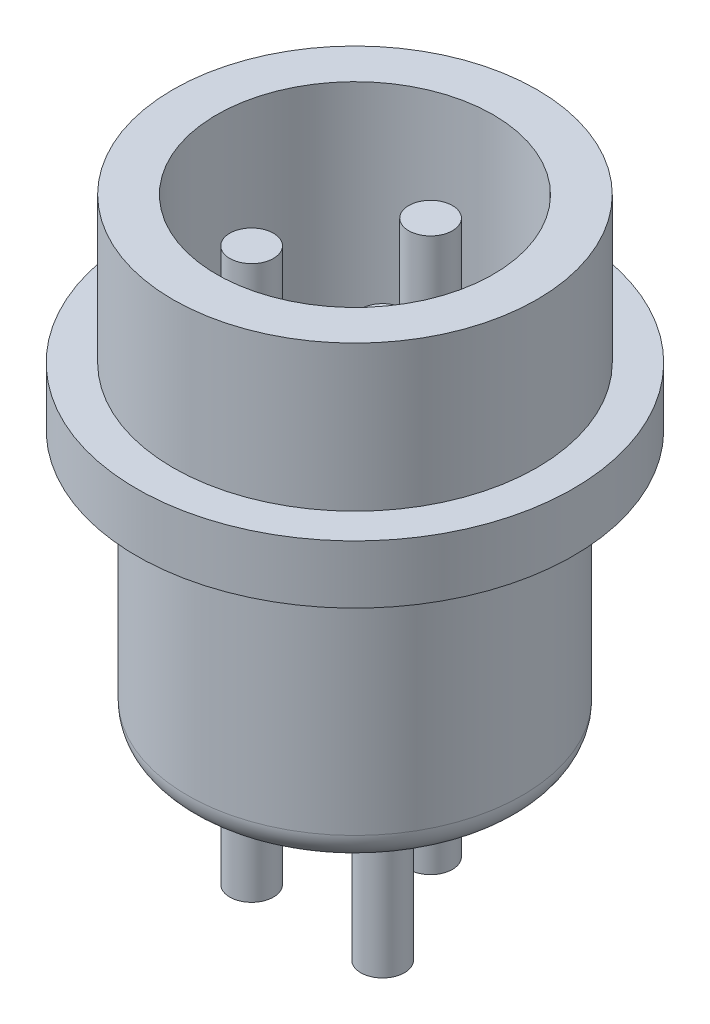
ISO-10303-21;
HEADER;
FILE_DESCRIPTION(('STEP AP214'),'2;1');
FILE_NAME('part.step','',(''),(''),'','','');
FILE_SCHEMA(('AUTOMOTIVE_DESIGN { 1 0 10303 214 1 1 1 1 }'));
ENDSEC;
DATA;
#1=APPLICATION_CONTEXT('core data for automotive mechanical design processes');
#2=APPLICATION_PROTOCOL_DEFINITION('international standard','automotive_design',2000,#1);
#3=PRODUCT_CONTEXT('',#1,'mechanical');
#4=PRODUCT('Part','Part','',(#3));
#5=PRODUCT_RELATED_PRODUCT_CATEGORY('part','',(#4));
#6=PRODUCT_DEFINITION_FORMATION('','',#4);
#7=PRODUCT_DEFINITION_CONTEXT('part definition',#1,'design');
#8=PRODUCT_DEFINITION('design','',#6,#7);
#9=PRODUCT_DEFINITION_SHAPE('','',#8);
#10=(LENGTH_UNIT() NAMED_UNIT(*) SI_UNIT(.MILLI.,.METRE.));
#11=(NAMED_UNIT(*) PLANE_ANGLE_UNIT() SI_UNIT($,.RADIAN.));
#12=(NAMED_UNIT(*) SI_UNIT($,.STERADIAN.) SOLID_ANGLE_UNIT());
#13=UNCERTAINTY_MEASURE_WITH_UNIT(LENGTH_MEASURE(1.E-05),#10,'distance_accuracy_value','');
#14=(GEOMETRIC_REPRESENTATION_CONTEXT(3) GLOBAL_UNCERTAINTY_ASSIGNED_CONTEXT((#13)) GLOBAL_UNIT_ASSIGNED_CONTEXT((#10,
#11,#12)) REPRESENTATION_CONTEXT('',''));
#15=CARTESIAN_POINT('',(0.,0.,0.));
#16=DIRECTION('',(0.,0.,1.));
#17=DIRECTION('',(1.,0.,0.));
#18=AXIS2_PLACEMENT_3D('',#15,#16,#17);
#19=CARTESIAN_POINT('',(0.,0.,0.));
#20=DIRECTION('',(0.,1.,0.));
#21=DIRECTION('',(0.,0.,1.));
#22=AXIS2_PLACEMENT_3D('',#19,#20,#21);
#23=PLANE('',#22);
#24=CARTESIAN_POINT('',(2.25,0.,1.29903810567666));
#25=DIRECTION('',(0.,1.,0.));
#26=DIRECTION('',(0.,0.,1.));
#27=AXIS2_PLACEMENT_3D('',#24,#25,#26);
#28=CIRCLE('',#27,0.75);
#29=CARTESIAN_POINT('',(2.25,0.,2.04903810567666));
#30=VERTEX_POINT('',#29);
#31=EDGE_CURVE('E42',#30,#30,#28,.T.);
#32=ORIENTED_EDGE('',*,*,#31,.F.);
#33=EDGE_LOOP('',(#32));
#34=FACE_BOUND('',#33,.T.);
#35=CARTESIAN_POINT('',(-2.25,0.,1.29903810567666));
#36=DIRECTION('',(0.,1.,0.));
#37=DIRECTION('',(0.,0.,1.));
#38=AXIS2_PLACEMENT_3D('',#35,#36,#37);
#39=CIRCLE('',#38,0.75);
#40=CARTESIAN_POINT('',(-2.25,0.,2.04903810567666));
#41=VERTEX_POINT('',#40);
#42=EDGE_CURVE('E51',#41,#41,#39,.T.);
#43=ORIENTED_EDGE('',*,*,#42,.F.);
#44=EDGE_LOOP('',(#43));
#45=FACE_BOUND('',#44,.T.);
#46=CARTESIAN_POINT('',(0.,0.,-2.59807621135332));
#47=DIRECTION('',(0.,1.,0.));
#48=DIRECTION('',(0.,0.,1.));
#49=AXIS2_PLACEMENT_3D('',#46,#47,#48);
#50=CIRCLE('',#49,0.75);
#51=CARTESIAN_POINT('',(0.,0.,-1.84807621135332));
#52=VERTEX_POINT('',#51);
#53=EDGE_CURVE('E55',#52,#52,#50,.T.);
#54=ORIENTED_EDGE('',*,*,#53,.F.);
#55=EDGE_LOOP('',(#54));
#56=FACE_BOUND('',#55,.T.);
#57=CARTESIAN_POINT('',(0.,0.,0.));
#58=DIRECTION('',(0.,-1.,0.));
#59=DIRECTION('',(0.,0.,-1.));
#60=AXIS2_PLACEMENT_3D('',#57,#58,#59);
#61=CIRCLE('',#60,4.75);
#62=CARTESIAN_POINT('',(0.,0.,-4.75));
#63=VERTEX_POINT('',#62);
#64=EDGE_CURVE('E59',#63,#63,#61,.T.);
#65=ORIENTED_EDGE('',*,*,#64,.F.);
#66=EDGE_LOOP('',(#65));
#67=FACE_BOUND('',#66,.T.);
#68=ADVANCED_FACE('F31',(#34,#45,#56,#67),#23,.T.);
#69=CARTESIAN_POINT('',(0.,0.,0.));
#70=DIRECTION('',(0.,-1.,0.));
#71=DIRECTION('',(0.,0.,-1.));
#72=AXIS2_PLACEMENT_3D('',#69,#70,#71);
#73=CYLINDRICAL_SURFACE('',#72,4.75);
#74=ORIENTED_EDGE('',*,*,#64,.T.);
#75=EDGE_LOOP('',(#74));
#76=FACE_BOUND('',#75,.T.);
#77=CARTESIAN_POINT('',(0.,10.,0.));
#78=DIRECTION('',(0.,-1.,0.));
#79=DIRECTION('',(0.,0.,-1.));
#80=AXIS2_PLACEMENT_3D('',#77,#78,#79);
#81=CIRCLE('',#80,4.75);
#82=CARTESIAN_POINT('',(0.,10.,-4.75));
#83=VERTEX_POINT('',#82);
#84=EDGE_CURVE('E62',#83,#83,#81,.T.);
#85=ORIENTED_EDGE('',*,*,#84,.F.);
#86=EDGE_LOOP('',(#85));
#87=FACE_BOUND('',#86,.T.);
#88=ADVANCED_FACE('F120',(#76,#87),#73,.F.);
#89=CARTESIAN_POINT('',(4.75,10.,0.));
#90=DIRECTION('',(0.,1.,0.));
#91=DIRECTION('',(0.,0.,1.));
#92=AXIS2_PLACEMENT_3D('',#89,#90,#91);
#93=PLANE('',#92);
#94=ORIENTED_EDGE('',*,*,#84,.T.);
#95=EDGE_LOOP('',(#94));
#96=FACE_BOUND('',#95,.T.);
#97=CARTESIAN_POINT('',(0.,10.,0.));
#98=DIRECTION('',(0.,-1.,0.));
#99=DIRECTION('',(0.,0.,-1.));
#100=AXIS2_PLACEMENT_3D('',#97,#98,#99);
#101=CIRCLE('',#100,6.25);
#102=CARTESIAN_POINT('',(0.,10.,-6.25));
#103=VERTEX_POINT('',#102);
#104=EDGE_CURVE('E65',#103,#103,#101,.T.);
#105=ORIENTED_EDGE('',*,*,#104,.F.);
#106=EDGE_LOOP('',(#105));
#107=FACE_BOUND('',#106,.T.);
#108=ADVANCED_FACE('F127',(#96,#107),#93,.T.);
#109=CARTESIAN_POINT('',(0.,0.,0.));
#110=DIRECTION('',(0.,-1.,0.));
#111=DIRECTION('',(0.,0.,-1.));
#112=AXIS2_PLACEMENT_3D('',#109,#110,#111);
#113=CYLINDRICAL_SURFACE('',#112,6.25);
#114=ORIENTED_EDGE('',*,*,#104,.T.);
#115=EDGE_LOOP('',(#114));
#116=FACE_BOUND('',#115,.T.);
#117=CARTESIAN_POINT('',(0.,5.,0.));
#118=DIRECTION('',(0.,-1.,0.));
#119=DIRECTION('',(0.,0.,-1.));
#120=AXIS2_PLACEMENT_3D('',#117,#118,#119);
#121=CIRCLE('',#120,6.25);
#122=CARTESIAN_POINT('',(0.,5.,-6.25));
#123=VERTEX_POINT('',#122);
#124=EDGE_CURVE('E68',#123,#123,#121,.T.);
#125=ORIENTED_EDGE('',*,*,#124,.F.);
#126=EDGE_LOOP('',(#125));
#127=FACE_BOUND('',#126,.T.);
#128=ADVANCED_FACE('F135',(#116,#127),#113,.T.);
#129=CARTESIAN_POINT('',(6.25,5.,0.));
#130=DIRECTION('',(0.,1.,0.));
#131=DIRECTION('',(0.,0.,1.));
#132=AXIS2_PLACEMENT_3D('',#129,#130,#131);
#133=PLANE('',#132);
#134=ORIENTED_EDGE('',*,*,#124,.T.);
#135=EDGE_LOOP('',(#134));
#136=FACE_BOUND('',#135,.T.);
#137=CARTESIAN_POINT('',(0.,5.,0.));
#138=DIRECTION('',(0.,-1.,0.));
#139=DIRECTION('',(0.,0.,-1.));
#140=AXIS2_PLACEMENT_3D('',#137,#138,#139);
#141=CIRCLE('',#140,7.5);
#142=CARTESIAN_POINT('',(0.,5.,-7.5));
#143=VERTEX_POINT('',#142);
#144=EDGE_CURVE('E71',#143,#143,#141,.T.);
#145=ORIENTED_EDGE('',*,*,#144,.F.);
#146=EDGE_LOOP('',(#145));
#147=FACE_BOUND('',#146,.T.);
#148=ADVANCED_FACE('F139',(#136,#147),#133,.T.);
#149=CARTESIAN_POINT('',(0.,0.,0.));
#150=DIRECTION('',(0.,-1.,0.));
#151=DIRECTION('',(0.,0.,-1.));
#152=AXIS2_PLACEMENT_3D('',#149,#150,#151);
#153=CYLINDRICAL_SURFACE('',#152,7.5);
#154=ORIENTED_EDGE('',*,*,#144,.T.);
#155=EDGE_LOOP('',(#154));
#156=FACE_BOUND('',#155,.T.);
#157=CARTESIAN_POINT('',(0.,3.,0.));
#158=DIRECTION('',(0.,-1.,0.));
#159=DIRECTION('',(0.,0.,-1.));
#160=AXIS2_PLACEMENT_3D('',#157,#158,#159);
#161=CIRCLE('',#160,7.5);
#162=CARTESIAN_POINT('',(0.,3.,-7.5));
#163=VERTEX_POINT('',#162);
#164=EDGE_CURVE('E74',#163,#163,#161,.T.);
#165=ORIENTED_EDGE('',*,*,#164,.F.);
#166=EDGE_LOOP('',(#165));
#167=FACE_BOUND('',#166,.T.);
#168=ADVANCED_FACE('F143',(#156,#167),#153,.T.);
#169=CARTESIAN_POINT('',(7.5,3.,0.));
#170=DIRECTION('',(0.,-1.,0.));
#171=DIRECTION('',(0.,0.,-1.));
#172=AXIS2_PLACEMENT_3D('',#169,#170,#171);
#173=PLANE('',#172);
#174=ORIENTED_EDGE('',*,*,#164,.T.);
#175=EDGE_LOOP('',(#174));
#176=FACE_BOUND('',#175,.T.);
#177=CARTESIAN_POINT('',(0.,3.,0.));
#178=DIRECTION('',(0.,-1.,0.));
#179=DIRECTION('',(0.,0.,-1.));
#180=AXIS2_PLACEMENT_3D('',#177,#178,#179);
#181=CIRCLE('',#180,5.75);
#182=CARTESIAN_POINT('',(0.,3.,-5.75));
#183=VERTEX_POINT('',#182);
#184=EDGE_CURVE('E77',#183,#183,#181,.T.);
#185=ORIENTED_EDGE('',*,*,#184,.F.);
#186=EDGE_LOOP('',(#185));
#187=FACE_BOUND('',#186,.T.);
#188=ADVANCED_FACE('F147',(#176,#187),#173,.T.);
#189=CARTESIAN_POINT('',(0.,0.,0.));
#190=DIRECTION('',(0.,-1.,0.));
#191=DIRECTION('',(0.,0.,-1.));
#192=AXIS2_PLACEMENT_3D('',#189,#190,#191);
#193=CYLINDRICAL_SURFACE('',#192,5.75);
#194=CARTESIAN_POINT('',(0.,-5.,0.));
#195=DIRECTION('',(0.,-1.,0.));
#196=DIRECTION('',(0.,0.,-1.));
#197=AXIS2_PLACEMENT_3D('',#194,#195,#196);
#198=CIRCLE('',#197,5.75);
#199=CARTESIAN_POINT('',(0.,-5.,-5.75));
#200=VERTEX_POINT('',#199);
#201=EDGE_CURVE('E10',#200,#200,#198,.F.);
#202=ORIENTED_EDGE('',*,*,#201,.T.);
#203=EDGE_LOOP('',(#202));
#204=FACE_BOUND('',#203,.T.);
#205=ORIENTED_EDGE('',*,*,#184,.T.);
#206=EDGE_LOOP('',(#205));
#207=FACE_BOUND('',#206,.T.);
#208=ADVANCED_FACE('F151',(#204,#207),#193,.T.);
#209=CARTESIAN_POINT('',(5.75,-6.,0.));
#210=DIRECTION('',(0.,-1.,0.));
#211=DIRECTION('',(0.,0.,-1.));
#212=AXIS2_PLACEMENT_3D('',#209,#210,#211);
#213=PLANE('',#212);
#214=CARTESIAN_POINT('',(0.,-6.,0.));
#215=DIRECTION('',(0.,-1.,0.));
#216=DIRECTION('',(0.,0.,-1.));
#217=AXIS2_PLACEMENT_3D('',#214,#215,#216);
#218=CIRCLE('',#217,4.75);
#219=CARTESIAN_POINT('',(0.,-6.,-4.75));
#220=VERTEX_POINT('',#219);
#221=EDGE_CURVE('E38',#220,#220,#218,.T.);
#222=ORIENTED_EDGE('',*,*,#221,.T.);
#223=EDGE_LOOP('',(#222));
#224=FACE_BOUND('',#223,.T.);
#225=CARTESIAN_POINT('',(2.25,-6.,1.29903810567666));
#226=DIRECTION('',(0.,-1.,0.));
#227=DIRECTION('',(0.,0.,-1.));
#228=AXIS2_PLACEMENT_3D('',#225,#226,#227);
#229=CIRCLE('',#228,0.75);
#230=CARTESIAN_POINT('',(2.25,-6.,0.549038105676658));
#231=VERTEX_POINT('',#230);
#232=EDGE_CURVE('E46',#231,#231,#229,.T.);
#233=ORIENTED_EDGE('',*,*,#232,.F.);
#234=EDGE_LOOP('',(#233));
#235=FACE_BOUND('',#234,.T.);
#236=CARTESIAN_POINT('',(-2.25,-6.,1.29903810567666));
#237=DIRECTION('',(0.,-1.,0.));
#238=DIRECTION('',(0.,0.,-1.));
#239=AXIS2_PLACEMENT_3D('',#236,#237,#238);
#240=CIRCLE('',#239,0.75);
#241=CARTESIAN_POINT('',(-2.25,-6.,0.549038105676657));
#242=VERTEX_POINT('',#241);
#243=EDGE_CURVE('E52',#242,#242,#240,.T.);
#244=ORIENTED_EDGE('',*,*,#243,.F.);
#245=EDGE_LOOP('',(#244));
#246=FACE_BOUND('',#245,.T.);
#247=CARTESIAN_POINT('',(0.,-6.,-2.59807621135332));
#248=DIRECTION('',(0.,-1.,0.));
#249=DIRECTION('',(0.,0.,-1.));
#250=AXIS2_PLACEMENT_3D('',#247,#248,#249);
#251=CIRCLE('',#250,0.75);
#252=CARTESIAN_POINT('',(0.,-6.,-3.34807621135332));
#253=VERTEX_POINT('',#252);
#254=EDGE_CURVE('E56',#253,#253,#251,.T.);
#255=ORIENTED_EDGE('',*,*,#254,.F.);
#256=EDGE_LOOP('',(#255));
#257=FACE_BOUND('',#256,.T.);
#258=ADVANCED_FACE('F155',(#224,#235,#246,#257),#213,.T.);
#259=CARTESIAN_POINT('',(0.,-11.,-2.59807621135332));
#260=DIRECTION('',(0.,1.,0.));
#261=DIRECTION('',(0.,0.,1.));
#262=AXIS2_PLACEMENT_3D('',#259,#260,#261);
#263=PLANE('',#262);
#264=CARTESIAN_POINT('',(0.,-11.,-2.59807621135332));
#265=DIRECTION('',(0.,1.,0.));
#266=DIRECTION('',(0.,0.,1.));
#267=AXIS2_PLACEMENT_3D('',#264,#265,#266);
#268=CIRCLE('',#267,0.75);
#269=CARTESIAN_POINT('',(0.,-11.,-1.84807621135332));
#270=VERTEX_POINT('',#269);
#271=EDGE_CURVE('E80',#270,#270,#268,.T.);
#272=ORIENTED_EDGE('',*,*,#271,.F.);
#273=EDGE_LOOP('',(#272));
#274=FACE_BOUND('',#273,.T.);
#275=ADVANCED_FACE('F158',(#274),#263,.F.);
#276=CARTESIAN_POINT('',(0.,-11.,-2.59807621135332));
#277=DIRECTION('',(0.,1.,0.));
#278=DIRECTION('',(0.,0.,1.));
#279=AXIS2_PLACEMENT_3D('',#276,#277,#278);
#280=CYLINDRICAL_SURFACE('',#279,0.75);
#281=ORIENTED_EDGE('',*,*,#254,.T.);
#282=EDGE_LOOP('',(#281));
#283=FACE_BOUND('',#282,.T.);
#284=ORIENTED_EDGE('',*,*,#271,.T.);
#285=EDGE_LOOP('',(#284));
#286=FACE_BOUND('',#285,.T.);
#287=ADVANCED_FACE('F159',(#283,#286),#280,.T.);
#288=ORIENTED_EDGE('',*,*,#53,.T.);
#289=EDGE_LOOP('',(#288));
#290=FACE_BOUND('',#289,.T.);
#291=CARTESIAN_POINT('',(0.,8.,-2.59807621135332));
#292=DIRECTION('',(0.,1.,0.));
#293=DIRECTION('',(0.,0.,1.));
#294=AXIS2_PLACEMENT_3D('',#291,#292,#293);
#295=CIRCLE('',#294,0.75);
#296=CARTESIAN_POINT('',(0.,8.,-1.84807621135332));
#297=VERTEX_POINT('',#296);
#298=EDGE_CURVE('E85',#297,#297,#295,.T.);
#299=ORIENTED_EDGE('',*,*,#298,.F.);
#300=EDGE_LOOP('',(#299));
#301=FACE_BOUND('',#300,.T.);
#302=ADVANCED_FACE('F162',(#290,#301),#280,.T.);
#303=CARTESIAN_POINT('',(0.,8.,-2.59807621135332));
#304=DIRECTION('',(0.,1.,0.));
#305=DIRECTION('',(0.,0.,1.));
#306=AXIS2_PLACEMENT_3D('',#303,#304,#305);
#307=PLANE('',#306);
#308=ORIENTED_EDGE('',*,*,#298,.T.);
#309=EDGE_LOOP('',(#308));
#310=FACE_BOUND('',#309,.T.);
#311=ADVANCED_FACE('F167',(#310),#307,.T.);
#312=CARTESIAN_POINT('',(-2.25,-11.,1.29903810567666));
#313=DIRECTION('',(0.,1.,0.));
#314=DIRECTION('',(0.,0.,1.));
#315=AXIS2_PLACEMENT_3D('',#312,#313,#314);
#316=PLANE('',#315);
#317=CARTESIAN_POINT('',(-2.25,-11.,1.29903810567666));
#318=DIRECTION('',(0.,1.,0.));
#319=DIRECTION('',(0.,0.,1.));
#320=AXIS2_PLACEMENT_3D('',#317,#318,#319);
#321=CIRCLE('',#320,0.75);
#322=CARTESIAN_POINT('',(-2.25,-11.,2.04903810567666));
#323=VERTEX_POINT('',#322);
#324=EDGE_CURVE('E88',#323,#323,#321,.T.);
#325=ORIENTED_EDGE('',*,*,#324,.F.);
#326=EDGE_LOOP('',(#325));
#327=FACE_BOUND('',#326,.T.);
#328=ADVANCED_FACE('F170',(#327),#316,.F.);
#329=CARTESIAN_POINT('',(-2.25,-11.,1.29903810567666));
#330=DIRECTION('',(0.,1.,0.));
#331=DIRECTION('',(0.,0.,1.));
#332=AXIS2_PLACEMENT_3D('',#329,#330,#331);
#333=CYLINDRICAL_SURFACE('',#332,0.75);
#334=ORIENTED_EDGE('',*,*,#243,.T.);
#335=EDGE_LOOP('',(#334));
#336=FACE_BOUND('',#335,.T.);
#337=ORIENTED_EDGE('',*,*,#324,.T.);
#338=EDGE_LOOP('',(#337));
#339=FACE_BOUND('',#338,.T.);
#340=ADVANCED_FACE('F172',(#336,#339),#333,.T.);
#341=ORIENTED_EDGE('',*,*,#42,.T.);
#342=EDGE_LOOP('',(#341));
#343=FACE_BOUND('',#342,.T.);
#344=CARTESIAN_POINT('',(-2.25,8.,1.29903810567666));
#345=DIRECTION('',(0.,1.,0.));
#346=DIRECTION('',(0.,0.,1.));
#347=AXIS2_PLACEMENT_3D('',#344,#345,#346);
#348=CIRCLE('',#347,0.75);
#349=CARTESIAN_POINT('',(-2.25,8.,2.04903810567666));
#350=VERTEX_POINT('',#349);
#351=EDGE_CURVE('E93',#350,#350,#348,.T.);
#352=ORIENTED_EDGE('',*,*,#351,.F.);
#353=EDGE_LOOP('',(#352));
#354=FACE_BOUND('',#353,.T.);
#355=ADVANCED_FACE('F175',(#343,#354),#333,.T.);
#356=CARTESIAN_POINT('',(-2.25,8.,1.29903810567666));
#357=DIRECTION('',(0.,1.,0.));
#358=DIRECTION('',(0.,0.,1.));
#359=AXIS2_PLACEMENT_3D('',#356,#357,#358);
#360=PLANE('',#359);
#361=ORIENTED_EDGE('',*,*,#351,.T.);
#362=EDGE_LOOP('',(#361));
#363=FACE_BOUND('',#362,.T.);
#364=ADVANCED_FACE('F179',(#363),#360,.T.);
#365=CARTESIAN_POINT('',(2.25,-11.,1.29903810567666));
#366=DIRECTION('',(0.,1.,0.));
#367=DIRECTION('',(0.,0.,1.));
#368=AXIS2_PLACEMENT_3D('',#365,#366,#367);
#369=PLANE('',#368);
#370=CARTESIAN_POINT('',(2.25,-11.,1.29903810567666));
#371=DIRECTION('',(0.,1.,0.));
#372=DIRECTION('',(0.,0.,1.));
#373=AXIS2_PLACEMENT_3D('',#370,#371,#372);
#374=CIRCLE('',#373,0.75);
#375=CARTESIAN_POINT('',(2.25,-11.,2.04903810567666));
#376=VERTEX_POINT('',#375);
#377=EDGE_CURVE('E95',#376,#376,#374,.T.);
#378=ORIENTED_EDGE('',*,*,#377,.F.);
#379=EDGE_LOOP('',(#378));
#380=FACE_BOUND('',#379,.T.);
#381=ADVANCED_FACE('F115',(#380),#369,.F.);
#382=CARTESIAN_POINT('',(2.25,-11.,1.29903810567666));
#383=DIRECTION('',(0.,1.,0.));
#384=DIRECTION('',(0.,0.,1.));
#385=AXIS2_PLACEMENT_3D('',#382,#383,#384);
#386=CYLINDRICAL_SURFACE('',#385,0.75);
#387=ORIENTED_EDGE('',*,*,#232,.T.);
#388=EDGE_LOOP('',(#387));
#389=FACE_BOUND('',#388,.T.);
#390=ORIENTED_EDGE('',*,*,#377,.T.);
#391=EDGE_LOOP('',(#390));
#392=FACE_BOUND('',#391,.T.);
#393=ADVANCED_FACE('F107',(#389,#392),#386,.T.);
#394=ORIENTED_EDGE('',*,*,#31,.T.);
#395=EDGE_LOOP('',(#394));
#396=FACE_BOUND('',#395,.T.);
#397=CARTESIAN_POINT('',(2.25,8.,1.29903810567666));
#398=DIRECTION('',(0.,1.,0.));
#399=DIRECTION('',(0.,0.,1.));
#400=AXIS2_PLACEMENT_3D('',#397,#398,#399);
#401=CIRCLE('',#400,0.75);
#402=CARTESIAN_POINT('',(2.25,8.,2.04903810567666));
#403=VERTEX_POINT('',#402);
#404=EDGE_CURVE('E99',#403,#403,#401,.T.);
#405=ORIENTED_EDGE('',*,*,#404,.F.);
#406=EDGE_LOOP('',(#405));
#407=FACE_BOUND('',#406,.T.);
#408=ADVANCED_FACE('F105',(#396,#407),#386,.T.);
#409=CARTESIAN_POINT('',(2.25,8.,1.29903810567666));
#410=DIRECTION('',(0.,1.,0.));
#411=DIRECTION('',(0.,0.,1.));
#412=AXIS2_PLACEMENT_3D('',#409,#410,#411);
#413=PLANE('',#412);
#414=ORIENTED_EDGE('',*,*,#404,.T.);
#415=EDGE_LOOP('',(#414));
#416=FACE_BOUND('',#415,.T.);
#417=ADVANCED_FACE('F103',(#416),#413,.T.);
#418=CARTESIAN_POINT('',(0.,-5.,0.));
#419=DIRECTION('',(0.,-1.,0.));
#420=DIRECTION('',(0.,0.,-1.));
#421=AXIS2_PLACEMENT_3D('',#418,#419,#420);
#422=TOROIDAL_SURFACE('',#421,4.75,1.);
#423=ORIENTED_EDGE('',*,*,#201,.F.);
#424=EDGE_LOOP('',(#423));
#425=FACE_BOUND('',#424,.T.);
#426=ORIENTED_EDGE('',*,*,#221,.F.);
#427=EDGE_LOOP('',(#426));
#428=FACE_BOUND('',#427,.T.);
#429=ADVANCED_FACE('F33',(#425,#428),#422,.T.);
#430=CLOSED_SHELL('',(#68,#88,#108,#128,#148,#168,#188,#208,#258,#275,#287,#302,#311,#328,#340,
#355,#364,#381,#393,#408,#417,#429));
#431=MANIFOLD_SOLID_BREP('B2',#430);
#432=ADVANCED_BREP_SHAPE_REPRESENTATION('',(#18,#431),#14);
#433=SHAPE_DEFINITION_REPRESENTATION(#9,#432);
ENDSEC;
END-ISO-10303-21;
